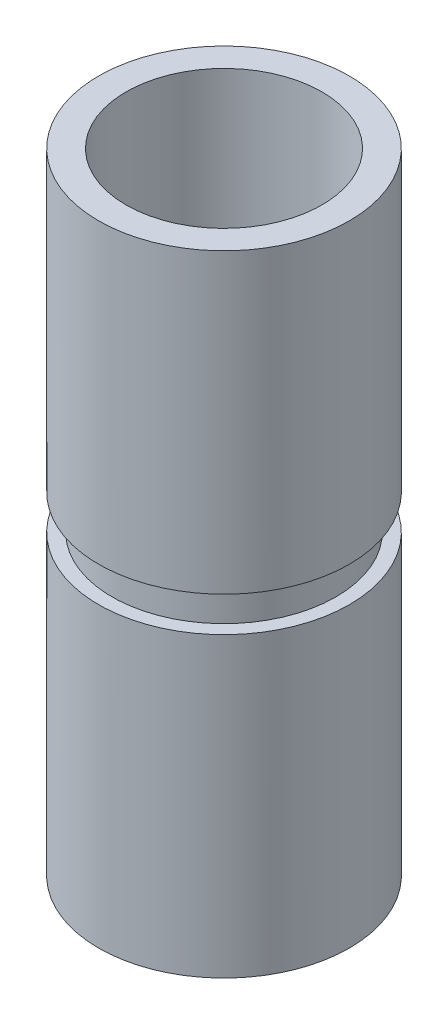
ISO-10303-21;
HEADER;
FILE_DESCRIPTION(('STEP AP214'),'2;1');
FILE_NAME('part.step','',(''),(''),'','','');
FILE_SCHEMA(('AUTOMOTIVE_DESIGN { 1 0 10303 214 1 1 1 1 }'));
ENDSEC;
DATA;
#1=APPLICATION_CONTEXT('core data for automotive mechanical design processes');
#2=APPLICATION_PROTOCOL_DEFINITION('international standard','automotive_design',2000,#1);
#3=PRODUCT_CONTEXT('',#1,'mechanical');
#4=PRODUCT('Part','Part','',(#3));
#5=PRODUCT_RELATED_PRODUCT_CATEGORY('part','',(#4));
#6=PRODUCT_DEFINITION_FORMATION('','',#4);
#7=PRODUCT_DEFINITION_CONTEXT('part definition',#1,'design');
#8=PRODUCT_DEFINITION('design','',#6,#7);
#9=PRODUCT_DEFINITION_SHAPE('','',#8);
#10=(LENGTH_UNIT() NAMED_UNIT(*) SI_UNIT(.MILLI.,.METRE.));
#11=(NAMED_UNIT(*) PLANE_ANGLE_UNIT() SI_UNIT($,.RADIAN.));
#12=(NAMED_UNIT(*) SI_UNIT($,.STERADIAN.) SOLID_ANGLE_UNIT());
#13=UNCERTAINTY_MEASURE_WITH_UNIT(LENGTH_MEASURE(1.E-05),#10,'distance_accuracy_value','');
#14=(GEOMETRIC_REPRESENTATION_CONTEXT(3) GLOBAL_UNCERTAINTY_ASSIGNED_CONTEXT((#13)) GLOBAL_UNIT_ASSIGNED_CONTEXT((#10,
#11,#12)) REPRESENTATION_CONTEXT('',''));
#15=CARTESIAN_POINT('',(0.,0.,0.));
#16=DIRECTION('',(0.,0.,1.));
#17=DIRECTION('',(1.,0.,0.));
#18=AXIS2_PLACEMENT_3D('',#15,#16,#17);
#19=CARTESIAN_POINT('',(0.,114.3,0.));
#20=DIRECTION('',(0.,-1.,0.));
#21=DIRECTION('',(0.,0.,-1.));
#22=AXIS2_PLACEMENT_3D('',#19,#20,#21);
#23=CYLINDRICAL_SURFACE('',#22,22.7584);
#24=CARTESIAN_POINT('',(0.,114.3,0.));
#25=DIRECTION('',(0.,1.,0.));
#26=DIRECTION('',(0.,0.,1.));
#27=AXIS2_PLACEMENT_3D('',#24,#25,#26);
#28=CIRCLE('',#27,22.7584);
#29=CARTESIAN_POINT('',(0.,114.3,22.7584));
#30=VERTEX_POINT('',#29);
#31=EDGE_CURVE('E10',#30,#30,#28,.T.);
#32=ORIENTED_EDGE('',*,*,#31,.F.);
#33=EDGE_LOOP('',(#32));
#34=FACE_BOUND('',#33,.T.);
#35=CARTESIAN_POINT('',(0.,60.325,0.));
#36=DIRECTION('',(0.,-1.,0.));
#37=DIRECTION('',(1.,0.,0.));
#38=AXIS2_PLACEMENT_3D('',#35,#36,#37);
#39=CIRCLE('',#38,22.7584);
#40=CARTESIAN_POINT('',(22.7584,60.3249999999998,0.));
#41=VERTEX_POINT('',#40);
#42=EDGE_CURVE('E36',#41,#41,#39,.T.);
#43=ORIENTED_EDGE('',*,*,#42,.F.);
#44=EDGE_LOOP('',(#43));
#45=FACE_BOUND('',#44,.T.);
#46=ADVANCED_FACE('F32',(#34,#45),#23,.T.);
#47=CARTESIAN_POINT('',(0.,114.3,0.));
#48=DIRECTION('',(0.,1.,0.));
#49=DIRECTION('',(0.,0.,1.));
#50=AXIS2_PLACEMENT_3D('',#47,#48,#49);
#51=PLANE('',#50);
#52=ORIENTED_EDGE('',*,*,#31,.T.);
#53=EDGE_LOOP('',(#52));
#54=FACE_BOUND('',#53,.T.);
#55=CARTESIAN_POINT('',(0.,114.3,0.));
#56=DIRECTION('',(0.,1.,0.));
#57=DIRECTION('',(0.,0.,1.));
#58=AXIS2_PLACEMENT_3D('',#55,#56,#57);
#59=CIRCLE('',#58,17.78);
#60=CARTESIAN_POINT('',(0.,114.3,17.78));
#61=VERTEX_POINT('',#60);
#62=EDGE_CURVE('E45',#61,#61,#59,.T.);
#63=ORIENTED_EDGE('',*,*,#62,.F.);
#64=EDGE_LOOP('',(#63));
#65=FACE_BOUND('',#64,.T.);
#66=ADVANCED_FACE('F85',(#54,#65),#51,.T.);
#67=CARTESIAN_POINT('',(0.,0.,0.));
#68=DIRECTION('',(0.,1.,0.));
#69=DIRECTION('',(0.,0.,1.));
#70=AXIS2_PLACEMENT_3D('',#67,#68,#69);
#71=PLANE('',#70);
#72=CARTESIAN_POINT('',(0.,0.,0.));
#73=DIRECTION('',(0.,1.,0.));
#74=DIRECTION('',(0.,0.,1.));
#75=AXIS2_PLACEMENT_3D('',#72,#73,#74);
#76=CIRCLE('',#75,22.7584);
#77=CARTESIAN_POINT('',(0.,0.,22.7584));
#78=VERTEX_POINT('',#77);
#79=EDGE_CURVE('E40',#78,#78,#76,.T.);
#80=ORIENTED_EDGE('',*,*,#79,.F.);
#81=EDGE_LOOP('',(#80));
#82=FACE_BOUND('',#81,.T.);
#83=CARTESIAN_POINT('',(0.,0.,0.));
#84=DIRECTION('',(0.,1.,0.));
#85=DIRECTION('',(0.,0.,1.));
#86=AXIS2_PLACEMENT_3D('',#83,#84,#85);
#87=CIRCLE('',#86,17.78);
#88=CARTESIAN_POINT('',(0.,0.,17.78));
#89=VERTEX_POINT('',#88);
#90=EDGE_CURVE('E48',#89,#89,#87,.T.);
#91=ORIENTED_EDGE('',*,*,#90,.T.);
#92=EDGE_LOOP('',(#91));
#93=FACE_BOUND('',#92,.T.);
#94=ADVANCED_FACE('F69',(#82,#93),#71,.F.);
#95=CARTESIAN_POINT('',(0.,53.975,0.));
#96=DIRECTION('',(0.,-1.,0.));
#97=DIRECTION('',(1.,0.,0.));
#98=AXIS2_PLACEMENT_3D('',#95,#96,#97);
#99=CIRCLE('',#98,22.7584);
#100=CARTESIAN_POINT('',(22.7584,53.9749999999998,0.));
#101=VERTEX_POINT('',#100);
#102=EDGE_CURVE('E50',#101,#101,#99,.T.);
#103=ORIENTED_EDGE('',*,*,#102,.T.);
#104=EDGE_LOOP('',(#103));
#105=FACE_BOUND('',#104,.T.);
#106=ORIENTED_EDGE('',*,*,#79,.T.);
#107=EDGE_LOOP('',(#106));
#108=FACE_BOUND('',#107,.T.);
#109=ADVANCED_FACE('F34',(#105,#108),#23,.T.);
#110=CARTESIAN_POINT('',(0.,114.3,0.));
#111=DIRECTION('',(0.,-1.,0.));
#112=DIRECTION('',(0.,0.,-1.));
#113=AXIS2_PLACEMENT_3D('',#110,#111,#112);
#114=CYLINDRICAL_SURFACE('',#113,17.78);
#115=ORIENTED_EDGE('',*,*,#62,.T.);
#116=EDGE_LOOP('',(#115));
#117=FACE_BOUND('',#116,.T.);
#118=ORIENTED_EDGE('',*,*,#90,.F.);
#119=EDGE_LOOP('',(#118));
#120=FACE_BOUND('',#119,.T.);
#121=ADVANCED_FACE('F71',(#117,#120),#114,.F.);
#122=CARTESIAN_POINT('',(4.21247223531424E-13,60.325,0.));
#123=DIRECTION('',(0.,-1.,0.));
#124=DIRECTION('',(1.,0.,0.));
#125=AXIS2_PLACEMENT_3D('',#122,#123,#124);
#126=PLANE('',#125);
#127=CARTESIAN_POINT('',(4.21247223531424E-13,60.325,0.));
#128=DIRECTION('',(0.,-1.,0.));
#129=DIRECTION('',(1.,0.,0.));
#130=AXIS2_PLACEMENT_3D('',#127,#128,#129);
#131=CIRCLE('',#130,20.32);
#132=CARTESIAN_POINT('',(20.3200000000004,60.3249999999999,0.));
#133=VERTEX_POINT('',#132);
#134=EDGE_CURVE('E52',#133,#133,#131,.T.);
#135=ORIENTED_EDGE('',*,*,#134,.F.);
#136=EDGE_LOOP('',(#135));
#137=FACE_BOUND('',#136,.T.);
#138=ORIENTED_EDGE('',*,*,#42,.T.);
#139=EDGE_LOOP('',(#138));
#140=FACE_BOUND('',#139,.T.);
#141=ADVANCED_FACE('F73',(#137,#140),#126,.T.);
#142=CARTESIAN_POINT('',(3.76905410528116E-13,53.975,0.));
#143=DIRECTION('',(0.,-1.,0.));
#144=DIRECTION('',(1.,0.,0.));
#145=AXIS2_PLACEMENT_3D('',#142,#143,#144);
#146=PLANE('',#145);
#147=CARTESIAN_POINT('',(3.76905410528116E-13,53.975,0.));
#148=DIRECTION('',(0.,-1.,0.));
#149=DIRECTION('',(1.,0.,0.));
#150=AXIS2_PLACEMENT_3D('',#147,#148,#149);
#151=CIRCLE('',#150,20.32);
#152=CARTESIAN_POINT('',(20.3200000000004,53.9749999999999,0.));
#153=VERTEX_POINT('',#152);
#154=EDGE_CURVE('E57',#153,#153,#151,.T.);
#155=ORIENTED_EDGE('',*,*,#154,.T.);
#156=EDGE_LOOP('',(#155));
#157=FACE_BOUND('',#156,.T.);
#158=ORIENTED_EDGE('',*,*,#102,.F.);
#159=EDGE_LOOP('',(#158));
#160=FACE_BOUND('',#159,.T.);
#161=ADVANCED_FACE('F79',(#157,#160),#146,.F.);
#162=CARTESIAN_POINT('',(4.21247223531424E-13,60.325,0.));
#163=DIRECTION('',(0.,-1.,0.));
#164=DIRECTION('',(1.,0.,0.));
#165=AXIS2_PLACEMENT_3D('',#162,#163,#164);
#166=CYLINDRICAL_SURFACE('',#165,20.32);
#167=ORIENTED_EDGE('',*,*,#134,.T.);
#168=EDGE_LOOP('',(#167));
#169=FACE_BOUND('',#168,.T.);
#170=ORIENTED_EDGE('',*,*,#154,.F.);
#171=EDGE_LOOP('',(#170));
#172=FACE_BOUND('',#171,.T.);
#173=ADVANCED_FACE('F124',(#169,#172),#166,.T.);
#174=CLOSED_SHELL('',(#46,#66,#94,#109,#121,#141,#161,#173));
#175=MANIFOLD_SOLID_BREP('B2',#174);
#176=ADVANCED_BREP_SHAPE_REPRESENTATION('',(#18,#175),#14);
#177=SHAPE_DEFINITION_REPRESENTATION(#9,#176);
ENDSEC;
END-ISO-10303-21;
